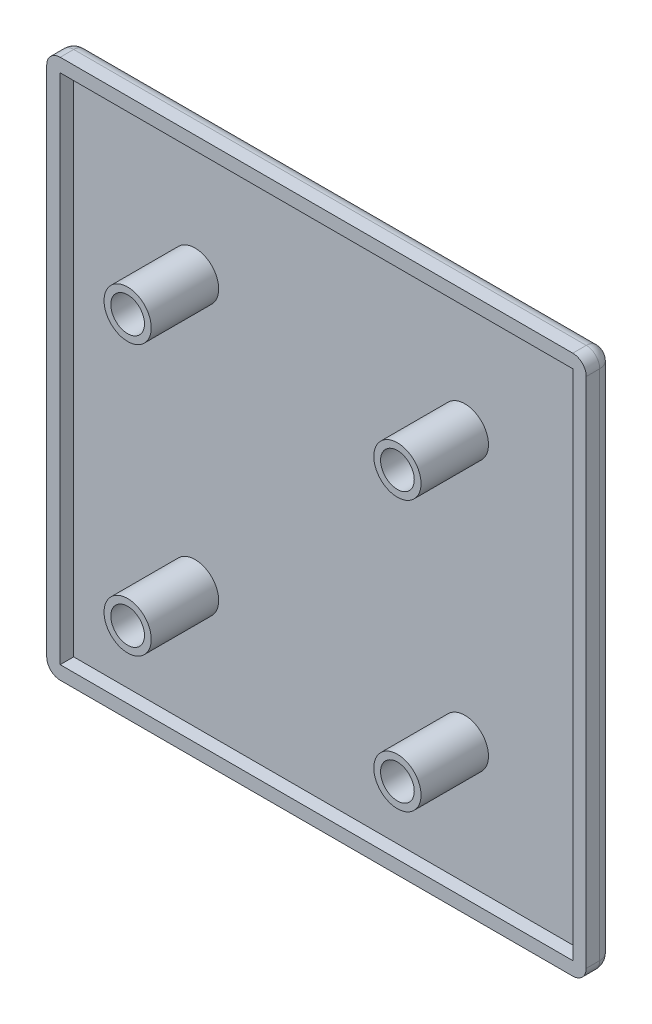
ISO-10303-21;
HEADER;
FILE_DESCRIPTION(('STEP AP214'),'2;1');
FILE_NAME('part.step','',(''),(''),'','','');
FILE_SCHEMA(('AUTOMOTIVE_DESIGN { 1 0 10303 214 1 1 1 1 }'));
ENDSEC;
DATA;
#1=APPLICATION_CONTEXT('core data for automotive mechanical design processes');
#2=APPLICATION_PROTOCOL_DEFINITION('international standard','automotive_design',2000,#1);
#3=PRODUCT_CONTEXT('',#1,'mechanical');
#4=PRODUCT('Part','Part','',(#3));
#5=PRODUCT_RELATED_PRODUCT_CATEGORY('part','',(#4));
#6=PRODUCT_DEFINITION_FORMATION('','',#4);
#7=PRODUCT_DEFINITION_CONTEXT('part definition',#1,'design');
#8=PRODUCT_DEFINITION('design','',#6,#7);
#9=PRODUCT_DEFINITION_SHAPE('','',#8);
#10=(LENGTH_UNIT() NAMED_UNIT(*) SI_UNIT(.MILLI.,.METRE.));
#11=(NAMED_UNIT(*) PLANE_ANGLE_UNIT() SI_UNIT($,.RADIAN.));
#12=(NAMED_UNIT(*) SI_UNIT($,.STERADIAN.) SOLID_ANGLE_UNIT());
#13=UNCERTAINTY_MEASURE_WITH_UNIT(LENGTH_MEASURE(1.E-05),#10,'distance_accuracy_value','');
#14=(GEOMETRIC_REPRESENTATION_CONTEXT(3) GLOBAL_UNCERTAINTY_ASSIGNED_CONTEXT((#13)) GLOBAL_UNIT_ASSIGNED_CONTEXT((#10,
#11,#12)) REPRESENTATION_CONTEXT('',''));
#15=CARTESIAN_POINT('',(0.,0.,0.));
#16=DIRECTION('',(0.,0.,1.));
#17=DIRECTION('',(1.,0.,0.));
#18=AXIS2_PLACEMENT_3D('',#15,#16,#17);
#19=CARTESIAN_POINT('',(0.,0.,0.));
#20=DIRECTION('',(0.,0.,1.));
#21=DIRECTION('',(1.,0.,0.));
#22=AXIS2_PLACEMENT_3D('',#19,#20,#21);
#23=PLANE('',#22);
#24=DIRECTION('',(0.,-1.,0.));
#25=VECTOR('',#24,1.);
#26=CARTESIAN_POINT('',(-38.,40.,0.));
#27=LINE('',#26,#25);
#28=CARTESIAN_POINT('',(-38.,38.,0.));
#29=VERTEX_POINT('',#28);
#30=CARTESIAN_POINT('',(-38.,-38.,0.));
#31=VERTEX_POINT('',#30);
#32=EDGE_CURVE('E141',#29,#31,#27,.T.);
#33=ORIENTED_EDGE('',*,*,#32,.T.);
#34=DIRECTION('',(1.,0.,0.));
#35=VECTOR('',#34,1.);
#36=CARTESIAN_POINT('',(-40.,-38.,0.));
#37=LINE('',#36,#35);
#38=CARTESIAN_POINT('',(38.,-38.,0.));
#39=VERTEX_POINT('',#38);
#40=EDGE_CURVE('E134',#31,#39,#37,.T.);
#41=ORIENTED_EDGE('',*,*,#40,.T.);
#42=DIRECTION('',(0.,1.,0.));
#43=VECTOR('',#42,1.);
#44=CARTESIAN_POINT('',(38.,40.,0.));
#45=LINE('',#44,#43);
#46=CARTESIAN_POINT('',(38.,38.,0.));
#47=VERTEX_POINT('',#46);
#48=EDGE_CURVE('E138',#39,#47,#45,.T.);
#49=ORIENTED_EDGE('',*,*,#48,.T.);
#50=DIRECTION('',(-1.,0.,0.));
#51=VECTOR('',#50,1.);
#52=CARTESIAN_POINT('',(-40.,38.,0.));
#53=LINE('',#52,#51);
#54=EDGE_CURVE('E159',#47,#29,#53,.T.);
#55=ORIENTED_EDGE('',*,*,#54,.T.);
#56=EDGE_LOOP('',(#33,#41,#49,#55));
#57=FACE_BOUND('',#56,.T.);
#58=CARTESIAN_POINT('',(-20.,20.,0.));
#59=DIRECTION('',(0.,0.,1.));
#60=DIRECTION('',(1.,0.,0.));
#61=AXIS2_PLACEMENT_3D('',#58,#59,#60);
#62=CIRCLE('',#61,3.5);
#63=CARTESIAN_POINT('',(-16.5,20.,0.));
#64=VERTEX_POINT('',#63);
#65=EDGE_CURVE('E304',#64,#64,#62,.T.);
#66=ORIENTED_EDGE('',*,*,#65,.F.);
#67=EDGE_LOOP('',(#66));
#68=FACE_BOUND('',#67,.T.);
#69=CARTESIAN_POINT('',(-20.,-20.,0.));
#70=DIRECTION('',(0.,0.,1.));
#71=DIRECTION('',(1.,0.,0.));
#72=AXIS2_PLACEMENT_3D('',#69,#70,#71);
#73=CIRCLE('',#72,3.5);
#74=CARTESIAN_POINT('',(-16.5,-20.,0.));
#75=VERTEX_POINT('',#74);
#76=EDGE_CURVE('E295',#75,#75,#73,.T.);
#77=ORIENTED_EDGE('',*,*,#76,.F.);
#78=EDGE_LOOP('',(#77));
#79=FACE_BOUND('',#78,.T.);
#80=CARTESIAN_POINT('',(20.,20.,0.));
#81=DIRECTION('',(0.,0.,1.));
#82=DIRECTION('',(1.,0.,0.));
#83=AXIS2_PLACEMENT_3D('',#80,#81,#82);
#84=CIRCLE('',#83,3.5);
#85=CARTESIAN_POINT('',(23.5,20.,0.));
#86=VERTEX_POINT('',#85);
#87=EDGE_CURVE('E286',#86,#86,#84,.T.);
#88=ORIENTED_EDGE('',*,*,#87,.F.);
#89=EDGE_LOOP('',(#88));
#90=FACE_BOUND('',#89,.T.);
#91=CARTESIAN_POINT('',(20.,-20.,0.));
#92=DIRECTION('',(0.,0.,1.));
#93=DIRECTION('',(1.,0.,0.));
#94=AXIS2_PLACEMENT_3D('',#91,#92,#93);
#95=CIRCLE('',#94,3.5);
#96=CARTESIAN_POINT('',(23.5,-20.,0.));
#97=VERTEX_POINT('',#96);
#98=EDGE_CURVE('E273',#97,#97,#95,.T.);
#99=ORIENTED_EDGE('',*,*,#98,.F.);
#100=EDGE_LOOP('',(#99));
#101=FACE_BOUND('',#100,.T.);
#102=ADVANCED_FACE('F35',(#57,#68,#79,#90,#101),#23,.T.);
#103=CARTESIAN_POINT('',(-40.,40.,2.));
#104=DIRECTION('',(1.,0.,0.));
#105=DIRECTION('',(0.,1.,0.));
#106=AXIS2_PLACEMENT_3D('',#103,#104,#105);
#107=PLANE('',#106);
#108=DIRECTION('',(0.,-1.,0.));
#109=VECTOR('',#108,1.);
#110=CARTESIAN_POINT('',(-40.,40.,2.));
#111=LINE('',#110,#109);
#112=CARTESIAN_POINT('',(-40.,38.,2.));
#113=VERTEX_POINT('',#112);
#114=CARTESIAN_POINT('',(-40.,-38.,2.));
#115=VERTEX_POINT('',#114);
#116=EDGE_CURVE('E172',#113,#115,#111,.T.);
#117=ORIENTED_EDGE('',*,*,#116,.F.);
#118=DIRECTION('',(0.,0.,-1.));
#119=VECTOR('',#118,1.);
#120=CARTESIAN_POINT('',(-40.,38.,2.));
#121=LINE('',#120,#119);
#122=CARTESIAN_POINT('',(-40.,38.,0.));
#123=VERTEX_POINT('',#122);
#124=EDGE_CURVE('E200',#113,#123,#121,.T.);
#125=ORIENTED_EDGE('',*,*,#124,.T.);
#126=DIRECTION('',(0.,-1.,0.));
#127=VECTOR('',#126,1.);
#128=CARTESIAN_POINT('',(-40.,40.,0.));
#129=LINE('',#128,#127);
#130=CARTESIAN_POINT('',(-40.,-38.,0.));
#131=VERTEX_POINT('',#130);
#132=EDGE_CURVE('E198',#123,#131,#129,.T.);
#133=ORIENTED_EDGE('',*,*,#132,.T.);
#134=DIRECTION('',(0.,0.,-1.));
#135=VECTOR('',#134,1.);
#136=CARTESIAN_POINT('',(-40.,-38.,2.));
#137=LINE('',#136,#135);
#138=EDGE_CURVE('E196',#131,#115,#137,.F.);
#139=ORIENTED_EDGE('',*,*,#138,.T.);
#140=EDGE_LOOP('',(#117,#125,#133,#139));
#141=FACE_BOUND('',#140,.T.);
#142=ADVANCED_FACE('F339',(#141),#107,.F.);
#143=CARTESIAN_POINT('',(-40.,-40.,2.));
#144=DIRECTION('',(0.,1.,0.));
#145=DIRECTION('',(0.,0.,1.));
#146=AXIS2_PLACEMENT_3D('',#143,#144,#145);
#147=PLANE('',#146);
#148=DIRECTION('',(1.,0.,0.));
#149=VECTOR('',#148,1.);
#150=CARTESIAN_POINT('',(-40.,-40.,2.));
#151=LINE('',#150,#149);
#152=CARTESIAN_POINT('',(-38.,-40.,2.));
#153=VERTEX_POINT('',#152);
#154=CARTESIAN_POINT('',(38.,-40.,2.));
#155=VERTEX_POINT('',#154);
#156=EDGE_CURVE('E175',#153,#155,#151,.T.);
#157=ORIENTED_EDGE('',*,*,#156,.F.);
#158=DIRECTION('',(0.,0.,-1.));
#159=VECTOR('',#158,1.);
#160=CARTESIAN_POINT('',(-38.,-40.,2.));
#161=LINE('',#160,#159);
#162=CARTESIAN_POINT('',(-38.,-40.,0.));
#163=VERTEX_POINT('',#162);
#164=EDGE_CURVE('E230',#153,#163,#161,.T.);
#165=ORIENTED_EDGE('',*,*,#164,.T.);
#166=DIRECTION('',(1.,0.,0.));
#167=VECTOR('',#166,1.);
#168=CARTESIAN_POINT('',(-40.,-40.,0.));
#169=LINE('',#168,#167);
#170=CARTESIAN_POINT('',(38.,-40.,0.));
#171=VERTEX_POINT('',#170);
#172=EDGE_CURVE('E228',#163,#171,#169,.T.);
#173=ORIENTED_EDGE('',*,*,#172,.T.);
#174=DIRECTION('',(0.,0.,-1.));
#175=VECTOR('',#174,1.);
#176=CARTESIAN_POINT('',(38.,-40.,2.));
#177=LINE('',#176,#175);
#178=EDGE_CURVE('E226',#171,#155,#177,.F.);
#179=ORIENTED_EDGE('',*,*,#178,.T.);
#180=EDGE_LOOP('',(#157,#165,#173,#179));
#181=FACE_BOUND('',#180,.T.);
#182=ADVANCED_FACE('F349',(#181),#147,.F.);
#183=CARTESIAN_POINT('',(40.,40.,2.));
#184=DIRECTION('',(-1.,0.,0.));
#185=DIRECTION('',(0.,-1.,0.));
#186=AXIS2_PLACEMENT_3D('',#183,#184,#185);
#187=PLANE('',#186);
#188=DIRECTION('',(0.,1.,0.));
#189=VECTOR('',#188,1.);
#190=CARTESIAN_POINT('',(40.,40.,2.));
#191=LINE('',#190,#189);
#192=CARTESIAN_POINT('',(40.,-38.,2.));
#193=VERTEX_POINT('',#192);
#194=CARTESIAN_POINT('',(40.,38.,2.));
#195=VERTEX_POINT('',#194);
#196=EDGE_CURVE('E178',#193,#195,#191,.T.);
#197=ORIENTED_EDGE('',*,*,#196,.F.);
#198=DIRECTION('',(0.,0.,-1.));
#199=VECTOR('',#198,1.);
#200=CARTESIAN_POINT('',(40.,-38.,2.));
#201=LINE('',#200,#199);
#202=CARTESIAN_POINT('',(40.,-38.,0.));
#203=VERTEX_POINT('',#202);
#204=EDGE_CURVE('E11',#193,#203,#201,.T.);
#205=ORIENTED_EDGE('',*,*,#204,.T.);
#206=DIRECTION('',(0.,1.,0.));
#207=VECTOR('',#206,1.);
#208=CARTESIAN_POINT('',(40.,40.,0.));
#209=LINE('',#208,#207);
#210=CARTESIAN_POINT('',(40.,38.,0.));
#211=VERTEX_POINT('',#210);
#212=EDGE_CURVE('E44',#203,#211,#209,.T.);
#213=ORIENTED_EDGE('',*,*,#212,.T.);
#214=DIRECTION('',(0.,0.,-1.));
#215=VECTOR('',#214,1.);
#216=CARTESIAN_POINT('',(40.,38.,2.));
#217=LINE('',#216,#215);
#218=EDGE_CURVE('E232',#211,#195,#217,.F.);
#219=ORIENTED_EDGE('',*,*,#218,.T.);
#220=EDGE_LOOP('',(#197,#205,#213,#219));
#221=FACE_BOUND('',#220,.T.);
#222=ADVANCED_FACE('F564',(#221),#187,.F.);
#223=CARTESIAN_POINT('',(-40.,40.,2.));
#224=DIRECTION('',(0.,-1.,0.));
#225=DIRECTION('',(1.,0.,0.));
#226=AXIS2_PLACEMENT_3D('',#223,#224,#225);
#227=PLANE('',#226);
#228=DIRECTION('',(-1.,0.,0.));
#229=VECTOR('',#228,1.);
#230=CARTESIAN_POINT('',(-40.,40.,0.));
#231=LINE('',#230,#229);
#232=CARTESIAN_POINT('',(38.,40.,0.));
#233=VERTEX_POINT('',#232);
#234=CARTESIAN_POINT('',(-38.,40.,0.));
#235=VERTEX_POINT('',#234);
#236=EDGE_CURVE('E205',#233,#235,#231,.T.);
#237=ORIENTED_EDGE('',*,*,#236,.T.);
#238=DIRECTION('',(0.,0.,-1.));
#239=VECTOR('',#238,1.);
#240=CARTESIAN_POINT('',(-38.,40.,2.));
#241=LINE('',#240,#239);
#242=CARTESIAN_POINT('',(-38.,40.,2.));
#243=VERTEX_POINT('',#242);
#244=EDGE_CURVE('E207',#235,#243,#241,.F.);
#245=ORIENTED_EDGE('',*,*,#244,.T.);
#246=DIRECTION('',(-1.,0.,0.));
#247=VECTOR('',#246,1.);
#248=CARTESIAN_POINT('',(-40.,40.,2.));
#249=LINE('',#248,#247);
#250=CARTESIAN_POINT('',(38.,40.,2.));
#251=VERTEX_POINT('',#250);
#252=EDGE_CURVE('E181',#251,#243,#249,.T.);
#253=ORIENTED_EDGE('',*,*,#252,.F.);
#254=DIRECTION('',(0.,0.,-1.));
#255=VECTOR('',#254,1.);
#256=CARTESIAN_POINT('',(38.,40.,2.));
#257=LINE('',#256,#255);
#258=EDGE_CURVE('E203',#251,#233,#257,.T.);
#259=ORIENTED_EDGE('',*,*,#258,.T.);
#260=EDGE_LOOP('',(#237,#245,#253,#259));
#261=FACE_BOUND('',#260,.T.);
#262=ADVANCED_FACE('F325',(#261),#227,.F.);
#263=CARTESIAN_POINT('',(0.,0.,2.));
#264=DIRECTION('',(0.,0.,1.));
#265=DIRECTION('',(1.,0.,0.));
#266=AXIS2_PLACEMENT_3D('',#263,#264,#265);
#267=PLANE('',#266);
#268=DIRECTION('',(0.,-1.,0.));
#269=VECTOR('',#268,1.);
#270=CARTESIAN_POINT('',(-38.,40.,2.));
#271=LINE('',#270,#269);
#272=CARTESIAN_POINT('',(-38.,38.,2.));
#273=VERTEX_POINT('',#272);
#274=CARTESIAN_POINT('',(-38.,-38.,2.));
#275=VERTEX_POINT('',#274);
#276=EDGE_CURVE('E161',#273,#275,#271,.T.);
#277=ORIENTED_EDGE('',*,*,#276,.F.);
#278=DIRECTION('',(-1.,0.,0.));
#279=VECTOR('',#278,1.);
#280=CARTESIAN_POINT('',(-40.,38.,2.));
#281=LINE('',#280,#279);
#282=CARTESIAN_POINT('',(38.,38.,2.));
#283=VERTEX_POINT('',#282);
#284=EDGE_CURVE('E170',#283,#273,#281,.T.);
#285=ORIENTED_EDGE('',*,*,#284,.F.);
#286=DIRECTION('',(0.,1.,0.));
#287=VECTOR('',#286,1.);
#288=CARTESIAN_POINT('',(38.,40.,2.));
#289=LINE('',#288,#287);
#290=CARTESIAN_POINT('',(38.,-38.,2.));
#291=VERTEX_POINT('',#290);
#292=EDGE_CURVE('E168',#291,#283,#289,.T.);
#293=ORIENTED_EDGE('',*,*,#292,.F.);
#294=DIRECTION('',(1.,0.,0.));
#295=VECTOR('',#294,1.);
#296=CARTESIAN_POINT('',(-40.,-38.,2.));
#297=LINE('',#296,#295);
#298=EDGE_CURVE('E150',#275,#291,#297,.T.);
#299=ORIENTED_EDGE('',*,*,#298,.F.);
#300=EDGE_LOOP('',(#277,#285,#293,#299));
#301=FACE_BOUND('',#300,.T.);
#302=ORIENTED_EDGE('',*,*,#252,.T.);
#303=CARTESIAN_POINT('',(-38.,38.,2.));
#304=DIRECTION('',(0.,0.,1.));
#305=DIRECTION('',(1.,0.,0.));
#306=AXIS2_PLACEMENT_3D('',#303,#304,#305);
#307=CIRCLE('',#306,2.);
#308=EDGE_CURVE('E215',#243,#113,#307,.T.);
#309=ORIENTED_EDGE('',*,*,#308,.T.);
#310=ORIENTED_EDGE('',*,*,#116,.T.);
#311=CARTESIAN_POINT('',(-38.,-38.,2.));
#312=DIRECTION('',(0.,0.,1.));
#313=DIRECTION('',(1.,0.,0.));
#314=AXIS2_PLACEMENT_3D('',#311,#312,#313);
#315=CIRCLE('',#314,2.);
#316=EDGE_CURVE('E213',#115,#153,#315,.T.);
#317=ORIENTED_EDGE('',*,*,#316,.T.);
#318=ORIENTED_EDGE('',*,*,#156,.T.);
#319=CARTESIAN_POINT('',(38.,-38.,2.));
#320=DIRECTION('',(0.,0.,1.));
#321=DIRECTION('',(1.,0.,0.));
#322=AXIS2_PLACEMENT_3D('',#319,#320,#321);
#323=CIRCLE('',#322,2.);
#324=EDGE_CURVE('E211',#155,#193,#323,.T.);
#325=ORIENTED_EDGE('',*,*,#324,.T.);
#326=ORIENTED_EDGE('',*,*,#196,.T.);
#327=CARTESIAN_POINT('',(38.,38.,2.));
#328=DIRECTION('',(0.,0.,1.));
#329=DIRECTION('',(1.,0.,0.));
#330=AXIS2_PLACEMENT_3D('',#327,#328,#329);
#331=CIRCLE('',#330,2.);
#332=EDGE_CURVE('E209',#195,#251,#331,.T.);
#333=ORIENTED_EDGE('',*,*,#332,.T.);
#334=EDGE_LOOP('',(#302,#309,#310,#317,#318,#325,#326,#333));
#335=FACE_BOUND('',#334,.T.);
#336=ADVANCED_FACE('F321',(#301,#335),#267,.T.);
#337=CARTESIAN_POINT('',(0.,0.,-2.));
#338=DIRECTION('',(0.,0.,1.));
#339=DIRECTION('',(1.,0.,0.));
#340=AXIS2_PLACEMENT_3D('',#337,#338,#339);
#341=PLANE('',#340);
#342=DIRECTION('',(1.,0.,0.));
#343=VECTOR('',#342,1.);
#344=CARTESIAN_POINT('',(0.,-38.,-2.));
#345=LINE('',#344,#343);
#346=CARTESIAN_POINT('',(38.,-38.,-2.));
#347=VERTEX_POINT('',#346);
#348=CARTESIAN_POINT('',(-38.,-38.,-2.));
#349=VERTEX_POINT('',#348);
#350=EDGE_CURVE('E221',#347,#349,#345,.F.);
#351=ORIENTED_EDGE('',*,*,#350,.T.);
#352=DIRECTION('',(0.,-1.,0.));
#353=VECTOR('',#352,1.);
#354=CARTESIAN_POINT('',(-38.,0.,-2.));
#355=LINE('',#354,#353);
#356=CARTESIAN_POINT('',(-38.,38.,-2.));
#357=VERTEX_POINT('',#356);
#358=EDGE_CURVE('E223',#349,#357,#355,.F.);
#359=ORIENTED_EDGE('',*,*,#358,.T.);
#360=DIRECTION('',(-1.,0.,0.));
#361=VECTOR('',#360,1.);
#362=CARTESIAN_POINT('',(0.,38.,-2.));
#363=LINE('',#362,#361);
#364=CARTESIAN_POINT('',(38.,38.,-2.));
#365=VERTEX_POINT('',#364);
#366=EDGE_CURVE('E217',#357,#365,#363,.F.);
#367=ORIENTED_EDGE('',*,*,#366,.T.);
#368=DIRECTION('',(0.,1.,0.));
#369=VECTOR('',#368,1.);
#370=CARTESIAN_POINT('',(38.,0.,-2.));
#371=LINE('',#370,#369);
#372=EDGE_CURVE('E219',#365,#347,#371,.F.);
#373=ORIENTED_EDGE('',*,*,#372,.T.);
#374=EDGE_LOOP('',(#351,#359,#367,#373));
#375=FACE_BOUND('',#374,.T.);
#376=ADVANCED_FACE('F324',(#375),#341,.F.);
#377=CARTESIAN_POINT('',(-38.,40.,2.));
#378=DIRECTION('',(1.,0.,0.));
#379=DIRECTION('',(0.,1.,0.));
#380=AXIS2_PLACEMENT_3D('',#377,#378,#379);
#381=PLANE('',#380);
#382=ORIENTED_EDGE('',*,*,#32,.F.);
#383=DIRECTION('',(0.,0.,-1.));
#384=VECTOR('',#383,1.);
#385=CARTESIAN_POINT('',(-38.,38.,2.));
#386=LINE('',#385,#384);
#387=EDGE_CURVE('E164',#273,#29,#386,.T.);
#388=ORIENTED_EDGE('',*,*,#387,.F.);
#389=ORIENTED_EDGE('',*,*,#276,.T.);
#390=DIRECTION('',(0.,0.,-1.));
#391=VECTOR('',#390,1.);
#392=CARTESIAN_POINT('',(-38.,-38.,2.));
#393=LINE('',#392,#391);
#394=EDGE_CURVE('E154',#275,#31,#393,.T.);
#395=ORIENTED_EDGE('',*,*,#394,.T.);
#396=EDGE_LOOP('',(#382,#388,#389,#395));
#397=FACE_BOUND('',#396,.T.);
#398=ADVANCED_FACE('F319',(#397),#381,.T.);
#399=CARTESIAN_POINT('',(-40.,-38.,2.));
#400=DIRECTION('',(0.,1.,0.));
#401=DIRECTION('',(0.,0.,1.));
#402=AXIS2_PLACEMENT_3D('',#399,#400,#401);
#403=PLANE('',#402);
#404=ORIENTED_EDGE('',*,*,#40,.F.);
#405=ORIENTED_EDGE('',*,*,#394,.F.);
#406=ORIENTED_EDGE('',*,*,#298,.T.);
#407=DIRECTION('',(0.,0.,-1.));
#408=VECTOR('',#407,1.);
#409=CARTESIAN_POINT('',(38.,-38.,2.));
#410=LINE('',#409,#408);
#411=EDGE_CURVE('E147',#291,#39,#410,.T.);
#412=ORIENTED_EDGE('',*,*,#411,.T.);
#413=EDGE_LOOP('',(#404,#405,#406,#412));
#414=FACE_BOUND('',#413,.T.);
#415=ADVANCED_FACE('F148',(#414),#403,.T.);
#416=CARTESIAN_POINT('',(38.,40.,2.));
#417=DIRECTION('',(-1.,0.,0.));
#418=DIRECTION('',(0.,-1.,0.));
#419=AXIS2_PLACEMENT_3D('',#416,#417,#418);
#420=PLANE('',#419);
#421=ORIENTED_EDGE('',*,*,#48,.F.);
#422=ORIENTED_EDGE('',*,*,#411,.F.);
#423=ORIENTED_EDGE('',*,*,#292,.T.);
#424=DIRECTION('',(0.,0.,-1.));
#425=VECTOR('',#424,1.);
#426=CARTESIAN_POINT('',(38.,38.,2.));
#427=LINE('',#426,#425);
#428=EDGE_CURVE('E155',#283,#47,#427,.T.);
#429=ORIENTED_EDGE('',*,*,#428,.T.);
#430=EDGE_LOOP('',(#421,#422,#423,#429));
#431=FACE_BOUND('',#430,.T.);
#432=ADVANCED_FACE('F157',(#431),#420,.T.);
#433=CARTESIAN_POINT('',(-40.,38.,2.));
#434=DIRECTION('',(0.,-1.,0.));
#435=DIRECTION('',(1.,0.,0.));
#436=AXIS2_PLACEMENT_3D('',#433,#434,#435);
#437=PLANE('',#436);
#438=ORIENTED_EDGE('',*,*,#54,.F.);
#439=ORIENTED_EDGE('',*,*,#428,.F.);
#440=ORIENTED_EDGE('',*,*,#284,.T.);
#441=ORIENTED_EDGE('',*,*,#387,.T.);
#442=EDGE_LOOP('',(#438,#439,#440,#441));
#443=FACE_BOUND('',#442,.T.);
#444=ADVANCED_FACE('F315',(#443),#437,.T.);
#445=CARTESIAN_POINT('',(-20.,20.,10.));
#446=DIRECTION('',(0.,0.,1.));
#447=DIRECTION('',(1.,0.,0.));
#448=AXIS2_PLACEMENT_3D('',#445,#446,#447);
#449=PLANE('',#448);
#450=CARTESIAN_POINT('',(-20.,20.,10.));
#451=DIRECTION('',(0.,0.,1.));
#452=DIRECTION('',(1.,0.,0.));
#453=AXIS2_PLACEMENT_3D('',#450,#451,#452);
#454=CIRCLE('',#453,3.5);
#455=CARTESIAN_POINT('',(-16.5,20.,10.));
#456=VERTEX_POINT('',#455);
#457=EDGE_CURVE('E305',#456,#456,#454,.T.);
#458=ORIENTED_EDGE('',*,*,#457,.T.);
#459=EDGE_LOOP('',(#458));
#460=FACE_BOUND('',#459,.T.);
#461=CARTESIAN_POINT('',(-20.,20.,10.));
#462=DIRECTION('',(0.,0.,1.));
#463=DIRECTION('',(1.,0.,0.));
#464=AXIS2_PLACEMENT_3D('',#461,#462,#463);
#465=CIRCLE('',#464,2.5);
#466=CARTESIAN_POINT('',(-17.5,20.,10.));
#467=VERTEX_POINT('',#466);
#468=EDGE_CURVE('E299',#467,#467,#465,.T.);
#469=ORIENTED_EDGE('',*,*,#468,.F.);
#470=EDGE_LOOP('',(#469));
#471=FACE_BOUND('',#470,.T.);
#472=ADVANCED_FACE('F442',(#460,#471),#449,.T.);
#473=CARTESIAN_POINT('',(-20.,20.,10.));
#474=DIRECTION('',(0.,0.,-1.));
#475=DIRECTION('',(-1.,0.,0.));
#476=AXIS2_PLACEMENT_3D('',#473,#474,#475);
#477=CYLINDRICAL_SURFACE('',#476,3.5);
#478=ORIENTED_EDGE('',*,*,#457,.F.);
#479=EDGE_LOOP('',(#478));
#480=FACE_BOUND('',#479,.T.);
#481=ORIENTED_EDGE('',*,*,#65,.T.);
#482=EDGE_LOOP('',(#481));
#483=FACE_BOUND('',#482,.T.);
#484=ADVANCED_FACE('F399',(#480,#483),#477,.T.);
#485=CARTESIAN_POINT('',(-20.,20.,10.));
#486=DIRECTION('',(0.,0.,-1.));
#487=DIRECTION('',(-1.,0.,0.));
#488=AXIS2_PLACEMENT_3D('',#485,#486,#487);
#489=CYLINDRICAL_SURFACE('',#488,2.5);
#490=ORIENTED_EDGE('',*,*,#468,.T.);
#491=EDGE_LOOP('',(#490));
#492=FACE_BOUND('',#491,.T.);
#493=CARTESIAN_POINT('',(-20.,20.,0.));
#494=DIRECTION('',(0.,0.,1.));
#495=DIRECTION('',(1.,0.,0.));
#496=AXIS2_PLACEMENT_3D('',#493,#494,#495);
#497=CIRCLE('',#496,2.5);
#498=CARTESIAN_POINT('',(-17.5,20.,0.));
#499=VERTEX_POINT('',#498);
#500=EDGE_CURVE('E184',#499,#499,#497,.F.);
#501=ORIENTED_EDGE('',*,*,#500,.T.);
#502=EDGE_LOOP('',(#501));
#503=FACE_BOUND('',#502,.T.);
#504=ADVANCED_FACE('F389',(#492,#503),#489,.F.);
#505=ORIENTED_EDGE('',*,*,#500,.F.);
#506=EDGE_LOOP('',(#505));
#507=FACE_BOUND('',#506,.T.);
#508=ADVANCED_FACE('F377',(#507),#23,.T.);
#509=CARTESIAN_POINT('',(-20.,-20.,10.));
#510=DIRECTION('',(0.,0.,1.));
#511=DIRECTION('',(1.,0.,0.));
#512=AXIS2_PLACEMENT_3D('',#509,#510,#511);
#513=PLANE('',#512);
#514=CARTESIAN_POINT('',(-20.,-20.,10.));
#515=DIRECTION('',(0.,0.,1.));
#516=DIRECTION('',(1.,0.,0.));
#517=AXIS2_PLACEMENT_3D('',#514,#515,#516);
#518=CIRCLE('',#517,3.5);
#519=CARTESIAN_POINT('',(-16.5,-20.,10.));
#520=VERTEX_POINT('',#519);
#521=EDGE_CURVE('E296',#520,#520,#518,.T.);
#522=ORIENTED_EDGE('',*,*,#521,.T.);
#523=EDGE_LOOP('',(#522));
#524=FACE_BOUND('',#523,.T.);
#525=CARTESIAN_POINT('',(-20.,-20.,10.));
#526=DIRECTION('',(0.,0.,1.));
#527=DIRECTION('',(1.,0.,0.));
#528=AXIS2_PLACEMENT_3D('',#525,#526,#527);
#529=CIRCLE('',#528,2.5);
#530=CARTESIAN_POINT('',(-17.5,-20.,10.));
#531=VERTEX_POINT('',#530);
#532=EDGE_CURVE('E290',#531,#531,#529,.T.);
#533=ORIENTED_EDGE('',*,*,#532,.F.);
#534=EDGE_LOOP('',(#533));
#535=FACE_BOUND('',#534,.T.);
#536=ADVANCED_FACE('F388',(#524,#535),#513,.T.);
#537=CARTESIAN_POINT('',(-20.,-20.,10.));
#538=DIRECTION('',(0.,0.,-1.));
#539=DIRECTION('',(-1.,0.,0.));
#540=AXIS2_PLACEMENT_3D('',#537,#538,#539);
#541=CYLINDRICAL_SURFACE('',#540,3.5);
#542=ORIENTED_EDGE('',*,*,#521,.F.);
#543=EDGE_LOOP('',(#542));
#544=FACE_BOUND('',#543,.T.);
#545=ORIENTED_EDGE('',*,*,#76,.T.);
#546=EDGE_LOOP('',(#545));
#547=FACE_BOUND('',#546,.T.);
#548=ADVANCED_FACE('F396',(#544,#547),#541,.T.);
#549=CARTESIAN_POINT('',(-20.,-20.,10.));
#550=DIRECTION('',(0.,0.,-1.));
#551=DIRECTION('',(-1.,0.,0.));
#552=AXIS2_PLACEMENT_3D('',#549,#550,#551);
#553=CYLINDRICAL_SURFACE('',#552,2.5);
#554=ORIENTED_EDGE('',*,*,#532,.T.);
#555=EDGE_LOOP('',(#554));
#556=FACE_BOUND('',#555,.T.);
#557=CARTESIAN_POINT('',(-20.,-20.,0.));
#558=DIRECTION('',(0.,0.,1.));
#559=DIRECTION('',(1.,0.,0.));
#560=AXIS2_PLACEMENT_3D('',#557,#558,#559);
#561=CIRCLE('',#560,2.5);
#562=CARTESIAN_POINT('',(-17.5,-20.,0.));
#563=VERTEX_POINT('',#562);
#564=EDGE_CURVE('E187',#563,#563,#561,.F.);
#565=ORIENTED_EDGE('',*,*,#564,.T.);
#566=EDGE_LOOP('',(#565));
#567=FACE_BOUND('',#566,.T.);
#568=ADVANCED_FACE('F405',(#556,#567),#553,.F.);
#569=ORIENTED_EDGE('',*,*,#564,.F.);
#570=EDGE_LOOP('',(#569));
#571=FACE_BOUND('',#570,.T.);
#572=ADVANCED_FACE('F391',(#571),#23,.T.);
#573=CARTESIAN_POINT('',(20.,20.,10.));
#574=DIRECTION('',(0.,0.,1.));
#575=DIRECTION('',(1.,0.,0.));
#576=AXIS2_PLACEMENT_3D('',#573,#574,#575);
#577=PLANE('',#576);
#578=CARTESIAN_POINT('',(20.,20.,10.));
#579=DIRECTION('',(0.,0.,1.));
#580=DIRECTION('',(1.,0.,0.));
#581=AXIS2_PLACEMENT_3D('',#578,#579,#580);
#582=CIRCLE('',#581,3.5);
#583=CARTESIAN_POINT('',(23.5,20.,10.));
#584=VERTEX_POINT('',#583);
#585=EDGE_CURVE('E287',#584,#584,#582,.T.);
#586=ORIENTED_EDGE('',*,*,#585,.T.);
#587=EDGE_LOOP('',(#586));
#588=FACE_BOUND('',#587,.T.);
#589=CARTESIAN_POINT('',(20.,20.,10.));
#590=DIRECTION('',(0.,0.,1.));
#591=DIRECTION('',(1.,0.,0.));
#592=AXIS2_PLACEMENT_3D('',#589,#590,#591);
#593=CIRCLE('',#592,2.5);
#594=CARTESIAN_POINT('',(22.5,20.,10.));
#595=VERTEX_POINT('',#594);
#596=EDGE_CURVE('E282',#595,#595,#593,.T.);
#597=ORIENTED_EDGE('',*,*,#596,.F.);
#598=EDGE_LOOP('',(#597));
#599=FACE_BOUND('',#598,.T.);
#600=ADVANCED_FACE('F404',(#588,#599),#577,.T.);
#601=CARTESIAN_POINT('',(20.,20.,10.));
#602=DIRECTION('',(0.,0.,-1.));
#603=DIRECTION('',(-1.,0.,0.));
#604=AXIS2_PLACEMENT_3D('',#601,#602,#603);
#605=CYLINDRICAL_SURFACE('',#604,3.5);
#606=ORIENTED_EDGE('',*,*,#585,.F.);
#607=EDGE_LOOP('',(#606));
#608=FACE_BOUND('',#607,.T.);
#609=ORIENTED_EDGE('',*,*,#87,.T.);
#610=EDGE_LOOP('',(#609));
#611=FACE_BOUND('',#610,.T.);
#612=ADVANCED_FACE('F411',(#608,#611),#605,.T.);
#613=CARTESIAN_POINT('',(20.,20.,10.));
#614=DIRECTION('',(0.,0.,-1.));
#615=DIRECTION('',(-1.,0.,0.));
#616=AXIS2_PLACEMENT_3D('',#613,#614,#615);
#617=CYLINDRICAL_SURFACE('',#616,2.5);
#618=ORIENTED_EDGE('',*,*,#596,.T.);
#619=EDGE_LOOP('',(#618));
#620=FACE_BOUND('',#619,.T.);
#621=CARTESIAN_POINT('',(20.,20.,0.));
#622=DIRECTION('',(0.,0.,1.));
#623=DIRECTION('',(1.,0.,0.));
#624=AXIS2_PLACEMENT_3D('',#621,#622,#623);
#625=CIRCLE('',#624,2.5);
#626=CARTESIAN_POINT('',(22.5,20.,0.));
#627=VERTEX_POINT('',#626);
#628=EDGE_CURVE('E190',#627,#627,#625,.F.);
#629=ORIENTED_EDGE('',*,*,#628,.T.);
#630=EDGE_LOOP('',(#629));
#631=FACE_BOUND('',#630,.T.);
#632=ADVANCED_FACE('F419',(#620,#631),#617,.F.);
#633=ORIENTED_EDGE('',*,*,#628,.F.);
#634=EDGE_LOOP('',(#633));
#635=FACE_BOUND('',#634,.T.);
#636=ADVANCED_FACE('F386',(#635),#23,.T.);
#637=CARTESIAN_POINT('',(20.,-20.,10.));
#638=DIRECTION('',(0.,0.,1.));
#639=DIRECTION('',(1.,0.,0.));
#640=AXIS2_PLACEMENT_3D('',#637,#638,#639);
#641=PLANE('',#640);
#642=CARTESIAN_POINT('',(20.,-20.,10.));
#643=DIRECTION('',(0.,0.,1.));
#644=DIRECTION('',(1.,0.,0.));
#645=AXIS2_PLACEMENT_3D('',#642,#643,#644);
#646=CIRCLE('',#645,3.5);
#647=CARTESIAN_POINT('',(23.5,-20.,10.));
#648=VERTEX_POINT('',#647);
#649=EDGE_CURVE('E278',#648,#648,#646,.T.);
#650=ORIENTED_EDGE('',*,*,#649,.T.);
#651=EDGE_LOOP('',(#650));
#652=FACE_BOUND('',#651,.T.);
#653=CARTESIAN_POINT('',(20.,-20.,10.));
#654=DIRECTION('',(0.,0.,1.));
#655=DIRECTION('',(1.,0.,0.));
#656=AXIS2_PLACEMENT_3D('',#653,#654,#655);
#657=CIRCLE('',#656,2.5);
#658=CARTESIAN_POINT('',(22.5,-20.,10.));
#659=VERTEX_POINT('',#658);
#660=EDGE_CURVE('E269',#659,#659,#657,.T.);
#661=ORIENTED_EDGE('',*,*,#660,.F.);
#662=EDGE_LOOP('',(#661));
#663=FACE_BOUND('',#662,.T.);
#664=ADVANCED_FACE('F418',(#652,#663),#641,.T.);
#665=CARTESIAN_POINT('',(20.,-20.,10.));
#666=DIRECTION('',(0.,0.,-1.));
#667=DIRECTION('',(-1.,0.,0.));
#668=AXIS2_PLACEMENT_3D('',#665,#666,#667);
#669=CYLINDRICAL_SURFACE('',#668,3.5);
#670=ORIENTED_EDGE('',*,*,#649,.F.);
#671=EDGE_LOOP('',(#670));
#672=FACE_BOUND('',#671,.T.);
#673=ORIENTED_EDGE('',*,*,#98,.T.);
#674=EDGE_LOOP('',(#673));
#675=FACE_BOUND('',#674,.T.);
#676=ADVANCED_FACE('F425',(#672,#675),#669,.T.);
#677=CARTESIAN_POINT('',(20.,-20.,10.));
#678=DIRECTION('',(0.,0.,-1.));
#679=DIRECTION('',(-1.,0.,0.));
#680=AXIS2_PLACEMENT_3D('',#677,#678,#679);
#681=CYLINDRICAL_SURFACE('',#680,2.5);
#682=ORIENTED_EDGE('',*,*,#660,.T.);
#683=EDGE_LOOP('',(#682));
#684=FACE_BOUND('',#683,.T.);
#685=CARTESIAN_POINT('',(20.,-20.,0.));
#686=DIRECTION('',(0.,0.,1.));
#687=DIRECTION('',(1.,0.,0.));
#688=AXIS2_PLACEMENT_3D('',#685,#686,#687);
#689=CIRCLE('',#688,2.5);
#690=CARTESIAN_POINT('',(22.5,-20.,0.));
#691=VERTEX_POINT('',#690);
#692=EDGE_CURVE('E193',#691,#691,#689,.F.);
#693=ORIENTED_EDGE('',*,*,#692,.T.);
#694=EDGE_LOOP('',(#693));
#695=FACE_BOUND('',#694,.T.);
#696=ADVANCED_FACE('F384',(#684,#695),#681,.F.);
#697=ORIENTED_EDGE('',*,*,#692,.F.);
#698=EDGE_LOOP('',(#697));
#699=FACE_BOUND('',#698,.T.);
#700=ADVANCED_FACE('F373',(#699),#23,.T.);
#701=CARTESIAN_POINT('',(38.,-38.,2.));
#702=DIRECTION('',(0.,0.,-1.));
#703=DIRECTION('',(-1.,0.,0.));
#704=AXIS2_PLACEMENT_3D('',#701,#702,#703);
#705=CYLINDRICAL_SURFACE('',#704,2.);
#706=CARTESIAN_POINT('',(38.,-38.,0.));
#707=DIRECTION('',(0.,0.,-1.));
#708=DIRECTION('',(-1.,0.,0.));
#709=AXIS2_PLACEMENT_3D('',#706,#707,#708);
#710=CIRCLE('',#709,2.);
#711=EDGE_CURVE('E39',#203,#171,#710,.T.);
#712=ORIENTED_EDGE('',*,*,#711,.F.);
#713=ORIENTED_EDGE('',*,*,#204,.F.);
#714=ORIENTED_EDGE('',*,*,#324,.F.);
#715=ORIENTED_EDGE('',*,*,#178,.F.);
#716=EDGE_LOOP('',(#712,#713,#714,#715));
#717=FACE_BOUND('',#716,.T.);
#718=ADVANCED_FACE('F37',(#717),#705,.T.);
#719=CARTESIAN_POINT('',(38.,-38.,0.));
#720=DIRECTION('',(0.,0.,1.));
#721=DIRECTION('',(1.,0.,0.));
#722=AXIS2_PLACEMENT_3D('',#719,#720,#721);
#723=SPHERICAL_SURFACE('',#722,2.);
#724=CARTESIAN_POINT('',(38.,-38.,0.));
#725=DIRECTION('',(0.,-1.,0.));
#726=DIRECTION('',(1.,0.,0.));
#727=AXIS2_PLACEMENT_3D('',#724,#725,#726);
#728=CIRCLE('',#727,2.);
#729=EDGE_CURVE('E260',#203,#347,#728,.F.);
#730=ORIENTED_EDGE('',*,*,#729,.F.);
#731=ORIENTED_EDGE('',*,*,#711,.T.);
#732=CARTESIAN_POINT('',(38.,-38.,0.));
#733=DIRECTION('',(1.,0.,0.));
#734=DIRECTION('',(0.,0.,-1.));
#735=AXIS2_PLACEMENT_3D('',#732,#733,#734);
#736=CIRCLE('',#735,2.);
#737=EDGE_CURVE('E262',#347,#171,#736,.F.);
#738=ORIENTED_EDGE('',*,*,#737,.F.);
#739=EDGE_LOOP('',(#730,#731,#738));
#740=FACE_BOUND('',#739,.T.);
#741=ADVANCED_FACE('F366',(#740),#723,.T.);
#742=CARTESIAN_POINT('',(-38.,-38.,2.));
#743=DIRECTION('',(0.,0.,-1.));
#744=DIRECTION('',(-1.,0.,0.));
#745=AXIS2_PLACEMENT_3D('',#742,#743,#744);
#746=CYLINDRICAL_SURFACE('',#745,2.);
#747=ORIENTED_EDGE('',*,*,#316,.F.);
#748=ORIENTED_EDGE('',*,*,#138,.F.);
#749=CARTESIAN_POINT('',(-38.,-38.,0.));
#750=DIRECTION('',(0.,0.,-1.));
#751=DIRECTION('',(-1.,0.,0.));
#752=AXIS2_PLACEMENT_3D('',#749,#750,#751);
#753=CIRCLE('',#752,2.);
#754=EDGE_CURVE('E257',#163,#131,#753,.T.);
#755=ORIENTED_EDGE('',*,*,#754,.F.);
#756=ORIENTED_EDGE('',*,*,#164,.F.);
#757=EDGE_LOOP('',(#747,#748,#755,#756));
#758=FACE_BOUND('',#757,.T.);
#759=ADVANCED_FACE('F346',(#758),#746,.T.);
#760=CARTESIAN_POINT('',(-40.,-38.,0.));
#761=DIRECTION('',(1.,0.,0.));
#762=DIRECTION('',(0.,0.,-1.));
#763=AXIS2_PLACEMENT_3D('',#760,#761,#762);
#764=CYLINDRICAL_SURFACE('',#763,2.);
#765=ORIENTED_EDGE('',*,*,#737,.T.);
#766=ORIENTED_EDGE('',*,*,#172,.F.);
#767=CARTESIAN_POINT('',(-38.,-38.,0.));
#768=DIRECTION('',(-1.,0.,0.));
#769=DIRECTION('',(0.,0.,1.));
#770=AXIS2_PLACEMENT_3D('',#767,#768,#769);
#771=CIRCLE('',#770,2.);
#772=EDGE_CURVE('E254',#349,#163,#771,.T.);
#773=ORIENTED_EDGE('',*,*,#772,.F.);
#774=ORIENTED_EDGE('',*,*,#350,.F.);
#775=EDGE_LOOP('',(#765,#766,#773,#774));
#776=FACE_BOUND('',#775,.T.);
#777=ADVANCED_FACE('F352',(#776),#764,.T.);
#778=CARTESIAN_POINT('',(38.,40.,0.));
#779=DIRECTION('',(0.,1.,0.));
#780=DIRECTION('',(-1.,0.,0.));
#781=AXIS2_PLACEMENT_3D('',#778,#779,#780);
#782=CYLINDRICAL_SURFACE('',#781,2.);
#783=ORIENTED_EDGE('',*,*,#729,.T.);
#784=ORIENTED_EDGE('',*,*,#372,.F.);
#785=CARTESIAN_POINT('',(38.,38.,0.));
#786=DIRECTION('',(0.,1.,0.));
#787=DIRECTION('',(0.,0.,1.));
#788=AXIS2_PLACEMENT_3D('',#785,#786,#787);
#789=CIRCLE('',#788,2.);
#790=EDGE_CURVE('E251',#211,#365,#789,.T.);
#791=ORIENTED_EDGE('',*,*,#790,.F.);
#792=ORIENTED_EDGE('',*,*,#212,.F.);
#793=EDGE_LOOP('',(#783,#784,#791,#792));
#794=FACE_BOUND('',#793,.T.);
#795=ADVANCED_FACE('F365',(#794),#782,.T.);
#796=CARTESIAN_POINT('',(38.,38.,2.));
#797=DIRECTION('',(0.,0.,-1.));
#798=DIRECTION('',(-1.,0.,0.));
#799=AXIS2_PLACEMENT_3D('',#796,#797,#798);
#800=CYLINDRICAL_SURFACE('',#799,2.);
#801=ORIENTED_EDGE('',*,*,#332,.F.);
#802=ORIENTED_EDGE('',*,*,#218,.F.);
#803=CARTESIAN_POINT('',(38.,38.,0.));
#804=DIRECTION('',(0.,0.,-1.));
#805=DIRECTION('',(-1.,0.,0.));
#806=AXIS2_PLACEMENT_3D('',#803,#804,#805);
#807=CIRCLE('',#806,2.);
#808=EDGE_CURVE('E248',#233,#211,#807,.T.);
#809=ORIENTED_EDGE('',*,*,#808,.F.);
#810=ORIENTED_EDGE('',*,*,#258,.F.);
#811=EDGE_LOOP('',(#801,#802,#809,#810));
#812=FACE_BOUND('',#811,.T.);
#813=ADVANCED_FACE('F630',(#812),#800,.T.);
#814=CARTESIAN_POINT('',(-38.,-38.,0.));
#815=DIRECTION('',(0.,0.,1.));
#816=DIRECTION('',(1.,0.,0.));
#817=AXIS2_PLACEMENT_3D('',#814,#815,#816);
#818=SPHERICAL_SURFACE('',#817,2.);
#819=ORIENTED_EDGE('',*,*,#772,.T.);
#820=ORIENTED_EDGE('',*,*,#754,.T.);
#821=CARTESIAN_POINT('',(-38.,-38.,0.));
#822=DIRECTION('',(0.,-1.,0.));
#823=DIRECTION('',(0.,0.,-1.));
#824=AXIS2_PLACEMENT_3D('',#821,#822,#823);
#825=CIRCLE('',#824,2.);
#826=EDGE_CURVE('E245',#349,#131,#825,.F.);
#827=ORIENTED_EDGE('',*,*,#826,.F.);
#828=EDGE_LOOP('',(#819,#820,#827));
#829=FACE_BOUND('',#828,.T.);
#830=ADVANCED_FACE('F356',(#829),#818,.T.);
#831=CARTESIAN_POINT('',(38.,38.,0.));
#832=DIRECTION('',(0.,0.,1.));
#833=DIRECTION('',(1.,0.,0.));
#834=AXIS2_PLACEMENT_3D('',#831,#832,#833);
#835=SPHERICAL_SURFACE('',#834,2.);
#836=ORIENTED_EDGE('',*,*,#808,.T.);
#837=ORIENTED_EDGE('',*,*,#790,.T.);
#838=CARTESIAN_POINT('',(38.,38.,0.));
#839=DIRECTION('',(1.,0.,0.));
#840=DIRECTION('',(0.,0.,-1.));
#841=AXIS2_PLACEMENT_3D('',#838,#839,#840);
#842=CIRCLE('',#841,2.);
#843=EDGE_CURVE('E242',#233,#365,#842,.F.);
#844=ORIENTED_EDGE('',*,*,#843,.F.);
#845=EDGE_LOOP('',(#836,#837,#844));
#846=FACE_BOUND('',#845,.T.);
#847=ADVANCED_FACE('F648',(#846),#835,.T.);
#848=CARTESIAN_POINT('',(-38.,40.,0.));
#849=DIRECTION('',(0.,-1.,0.));
#850=DIRECTION('',(1.,0.,0.));
#851=AXIS2_PLACEMENT_3D('',#848,#849,#850);
#852=CYLINDRICAL_SURFACE('',#851,2.);
#853=ORIENTED_EDGE('',*,*,#826,.T.);
#854=ORIENTED_EDGE('',*,*,#132,.F.);
#855=CARTESIAN_POINT('',(-38.,38.,0.));
#856=DIRECTION('',(0.,1.,0.));
#857=DIRECTION('',(0.,0.,1.));
#858=AXIS2_PLACEMENT_3D('',#855,#856,#857);
#859=CIRCLE('',#858,2.);
#860=EDGE_CURVE('E239',#357,#123,#859,.T.);
#861=ORIENTED_EDGE('',*,*,#860,.F.);
#862=ORIENTED_EDGE('',*,*,#358,.F.);
#863=EDGE_LOOP('',(#853,#854,#861,#862));
#864=FACE_BOUND('',#863,.T.);
#865=ADVANCED_FACE('F359',(#864),#852,.T.);
#866=CARTESIAN_POINT('',(-40.,38.,0.));
#867=DIRECTION('',(-1.,0.,0.));
#868=DIRECTION('',(0.,-1.,0.));
#869=AXIS2_PLACEMENT_3D('',#866,#867,#868);
#870=CYLINDRICAL_SURFACE('',#869,2.);
#871=ORIENTED_EDGE('',*,*,#843,.T.);
#872=ORIENTED_EDGE('',*,*,#366,.F.);
#873=CARTESIAN_POINT('',(-38.,38.,0.));
#874=DIRECTION('',(-1.,0.,0.));
#875=DIRECTION('',(0.,0.,1.));
#876=AXIS2_PLACEMENT_3D('',#873,#874,#875);
#877=CIRCLE('',#876,2.);
#878=EDGE_CURVE('E237',#235,#357,#877,.T.);
#879=ORIENTED_EDGE('',*,*,#878,.F.);
#880=ORIENTED_EDGE('',*,*,#236,.F.);
#881=EDGE_LOOP('',(#871,#872,#879,#880));
#882=FACE_BOUND('',#881,.T.);
#883=ADVANCED_FACE('F666',(#882),#870,.T.);
#884=CARTESIAN_POINT('',(-38.,38.,0.));
#885=DIRECTION('',(0.,0.,1.));
#886=DIRECTION('',(1.,0.,0.));
#887=AXIS2_PLACEMENT_3D('',#884,#885,#886);
#888=SPHERICAL_SURFACE('',#887,2.);
#889=ORIENTED_EDGE('',*,*,#878,.T.);
#890=ORIENTED_EDGE('',*,*,#860,.T.);
#891=CARTESIAN_POINT('',(-38.,38.,0.));
#892=DIRECTION('',(0.,0.,-1.));
#893=DIRECTION('',(-1.,0.,0.));
#894=AXIS2_PLACEMENT_3D('',#891,#892,#893);
#895=CIRCLE('',#894,2.);
#896=EDGE_CURVE('E235',#235,#123,#895,.F.);
#897=ORIENTED_EDGE('',*,*,#896,.F.);
#898=EDGE_LOOP('',(#889,#890,#897));
#899=FACE_BOUND('',#898,.T.);
#900=ADVANCED_FACE('F675',(#899),#888,.T.);
#901=CARTESIAN_POINT('',(-38.,38.,2.));
#902=DIRECTION('',(0.,0.,-1.));
#903=DIRECTION('',(-1.,0.,0.));
#904=AXIS2_PLACEMENT_3D('',#901,#902,#903);
#905=CYLINDRICAL_SURFACE('',#904,2.);
#906=ORIENTED_EDGE('',*,*,#308,.F.);
#907=ORIENTED_EDGE('',*,*,#244,.F.);
#908=ORIENTED_EDGE('',*,*,#896,.T.);
#909=ORIENTED_EDGE('',*,*,#124,.F.);
#910=EDGE_LOOP('',(#906,#907,#908,#909));
#911=FACE_BOUND('',#910,.T.);
#912=ADVANCED_FACE('F336',(#911),#905,.T.);
#913=CLOSED_SHELL('',(#102,#142,#182,#222,#262,#336,#376,#398,#415,#432,#444,#472,#484,#504,
#508,#536,#548,#568,#572,#600,#612,#632,#636,#664,#676,#696,#700,#718,#741,#759,#777,#795,#813,
#830,#847,#865,#883,#900,#912));
#914=MANIFOLD_SOLID_BREP('B2',#913);
#915=ADVANCED_BREP_SHAPE_REPRESENTATION('',(#18,#914),#14);
#916=SHAPE_DEFINITION_REPRESENTATION(#9,#915);
ENDSEC;
END-ISO-10303-21;
